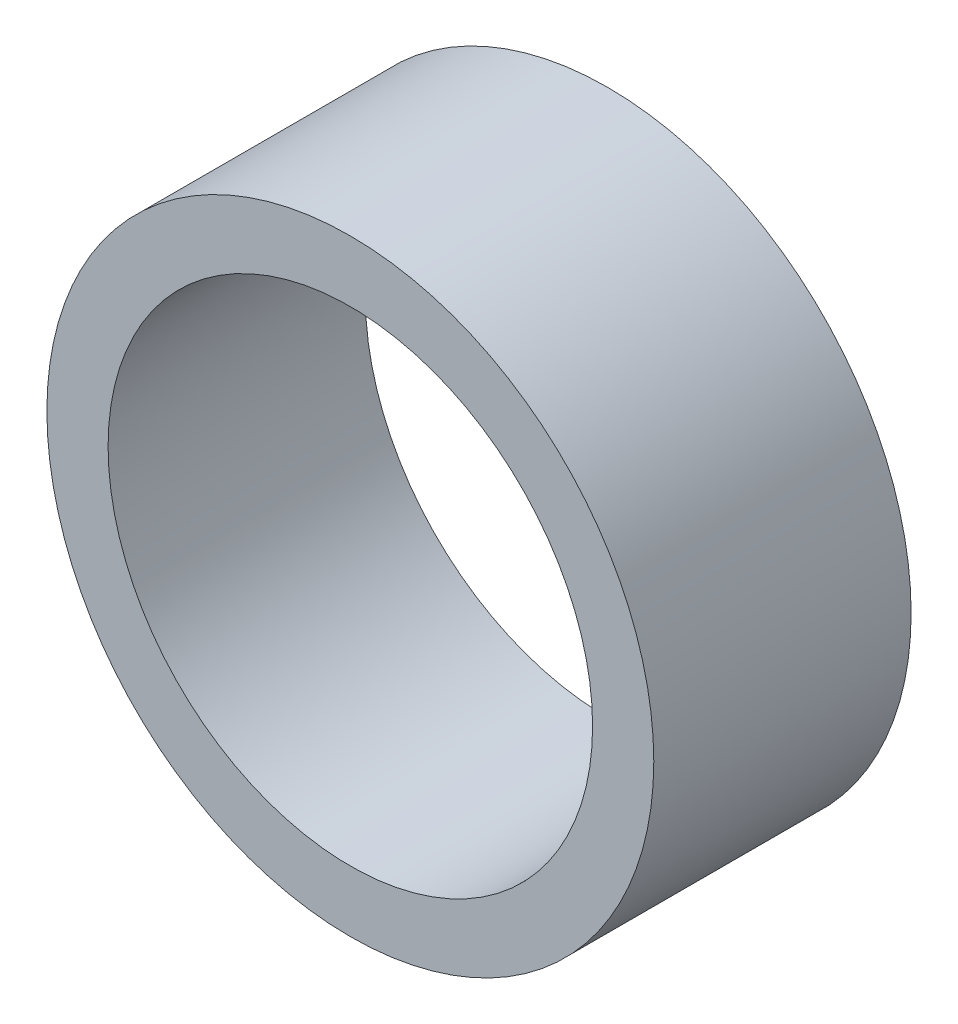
ISO-10303-21;
HEADER;
FILE_DESCRIPTION(('STEP AP214'),'2;1');
FILE_NAME('part.step','',(''),(''),'','','');
FILE_SCHEMA(('AUTOMOTIVE_DESIGN { 1 0 10303 214 1 1 1 1 }'));
ENDSEC;
DATA;
#1=APPLICATION_CONTEXT('core data for automotive mechanical design processes');
#2=APPLICATION_PROTOCOL_DEFINITION('international standard','automotive_design',2000,#1);
#3=PRODUCT_CONTEXT('',#1,'mechanical');
#4=PRODUCT('Part','Part','',(#3));
#5=PRODUCT_RELATED_PRODUCT_CATEGORY('part','',(#4));
#6=PRODUCT_DEFINITION_FORMATION('','',#4);
#7=PRODUCT_DEFINITION_CONTEXT('part definition',#1,'design');
#8=PRODUCT_DEFINITION('design','',#6,#7);
#9=PRODUCT_DEFINITION_SHAPE('','',#8);
#10=(LENGTH_UNIT() NAMED_UNIT(*) SI_UNIT(.MILLI.,.METRE.));
#11=(NAMED_UNIT(*) PLANE_ANGLE_UNIT() SI_UNIT($,.RADIAN.));
#12=(NAMED_UNIT(*) SI_UNIT($,.STERADIAN.) SOLID_ANGLE_UNIT());
#13=UNCERTAINTY_MEASURE_WITH_UNIT(LENGTH_MEASURE(1.E-05),#10,'distance_accuracy_value','');
#14=(GEOMETRIC_REPRESENTATION_CONTEXT(3) GLOBAL_UNCERTAINTY_ASSIGNED_CONTEXT((#13)) GLOBAL_UNIT_ASSIGNED_CONTEXT((#10,
#11,#12)) REPRESENTATION_CONTEXT('',''));
#15=CARTESIAN_POINT('',(0.,0.,0.));
#16=DIRECTION('',(0.,0.,1.));
#17=DIRECTION('',(1.,0.,0.));
#18=AXIS2_PLACEMENT_3D('',#15,#16,#17);
#19=CARTESIAN_POINT('',(1.16839999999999,0.,5.20699999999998));
#20=DIRECTION('',(0.,0.,-1.));
#21=DIRECTION('',(-1.,0.,0.));
#22=AXIS2_PLACEMENT_3D('',#19,#20,#21);
#23=CYLINDRICAL_SURFACE('',#22,6.14045);
#24=CARTESIAN_POINT('',(1.16839999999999,0.,5.20699999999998));
#25=DIRECTION('',(0.,0.,1.));
#26=DIRECTION('',(1.,0.,0.));
#27=AXIS2_PLACEMENT_3D('',#24,#25,#26);
#28=CIRCLE('',#27,6.14045);
#29=CARTESIAN_POINT('',(7.30885000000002,0.,5.20699999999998));
#30=VERTEX_POINT('',#29);
#31=EDGE_CURVE('E10',#30,#30,#28,.T.);
#32=ORIENTED_EDGE('',*,*,#31,.F.);
#33=EDGE_LOOP('',(#32));
#34=FACE_BOUND('',#33,.T.);
#35=CARTESIAN_POINT('',(1.16840000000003,0.,0.));
#36=DIRECTION('',(0.,0.,1.));
#37=DIRECTION('',(1.,0.,0.));
#38=AXIS2_PLACEMENT_3D('',#35,#36,#37);
#39=CIRCLE('',#38,6.14045);
#40=CARTESIAN_POINT('',(7.30885000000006,0.,0.));
#41=VERTEX_POINT('',#40);
#42=EDGE_CURVE('E43',#41,#41,#39,.T.);
#43=ORIENTED_EDGE('',*,*,#42,.T.);
#44=EDGE_LOOP('',(#43));
#45=FACE_BOUND('',#44,.T.);
#46=ADVANCED_FACE('F40',(#34,#45),#23,.T.);
#47=CARTESIAN_POINT('',(1.16839999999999,0.,5.20699999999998));
#48=DIRECTION('',(0.,0.,1.));
#49=DIRECTION('',(1.,0.,0.));
#50=AXIS2_PLACEMENT_3D('',#47,#48,#49);
#51=PLANE('',#50);
#52=CARTESIAN_POINT('',(1.16839999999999,0.,5.20699999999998));
#53=DIRECTION('',(0.,0.,-1.));
#54=DIRECTION('',(-1.,0.,0.));
#55=AXIS2_PLACEMENT_3D('',#52,#53,#54);
#56=CIRCLE('',#55,4.9022);
#57=CARTESIAN_POINT('',(-3.73380000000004,0.,5.20699999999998));
#58=VERTEX_POINT('',#57);
#59=EDGE_CURVE('E53',#58,#58,#56,.T.);
#60=ORIENTED_EDGE('',*,*,#59,.T.);
#61=EDGE_LOOP('',(#60));
#62=FACE_BOUND('',#61,.T.);
#63=ORIENTED_EDGE('',*,*,#31,.T.);
#64=EDGE_LOOP('',(#63));
#65=FACE_BOUND('',#64,.T.);
#66=ADVANCED_FACE('F62',(#62,#65),#51,.T.);
#67=CARTESIAN_POINT('',(1.16840000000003,0.,0.));
#68=DIRECTION('',(0.,0.,1.));
#69=DIRECTION('',(1.,0.,0.));
#70=AXIS2_PLACEMENT_3D('',#67,#68,#69);
#71=PLANE('',#70);
#72=CARTESIAN_POINT('',(1.16840000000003,0.,0.));
#73=DIRECTION('',(0.,0.,-1.));
#74=DIRECTION('',(-1.,0.,0.));
#75=AXIS2_PLACEMENT_3D('',#72,#73,#74);
#76=CIRCLE('',#75,4.9022);
#77=CARTESIAN_POINT('',(-3.7338,0.,0.));
#78=VERTEX_POINT('',#77);
#79=EDGE_CURVE('E55',#78,#78,#76,.T.);
#80=ORIENTED_EDGE('',*,*,#79,.F.);
#81=EDGE_LOOP('',(#80));
#82=FACE_BOUND('',#81,.T.);
#83=ORIENTED_EDGE('',*,*,#42,.F.);
#84=EDGE_LOOP('',(#83));
#85=FACE_BOUND('',#84,.T.);
#86=ADVANCED_FACE('F67',(#82,#85),#71,.F.);
#87=CARTESIAN_POINT('',(1.16839999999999,0.,5.20699999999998));
#88=DIRECTION('',(0.,0.,-1.));
#89=DIRECTION('',(-1.,0.,0.));
#90=AXIS2_PLACEMENT_3D('',#87,#88,#89);
#91=CYLINDRICAL_SURFACE('',#90,4.9022);
#92=ORIENTED_EDGE('',*,*,#59,.F.);
#93=EDGE_LOOP('',(#92));
#94=FACE_BOUND('',#93,.T.);
#95=ORIENTED_EDGE('',*,*,#79,.T.);
#96=EDGE_LOOP('',(#95));
#97=FACE_BOUND('',#96,.T.);
#98=ADVANCED_FACE('F64',(#94,#97),#91,.F.);
#99=CLOSED_SHELL('',(#46,#66,#86,#98));
#100=MANIFOLD_SOLID_BREP('B2',#99);
#101=ADVANCED_BREP_SHAPE_REPRESENTATION('',(#18,#100),#14);
#102=SHAPE_DEFINITION_REPRESENTATION(#9,#101);
ENDSEC;
END-ISO-10303-21;
